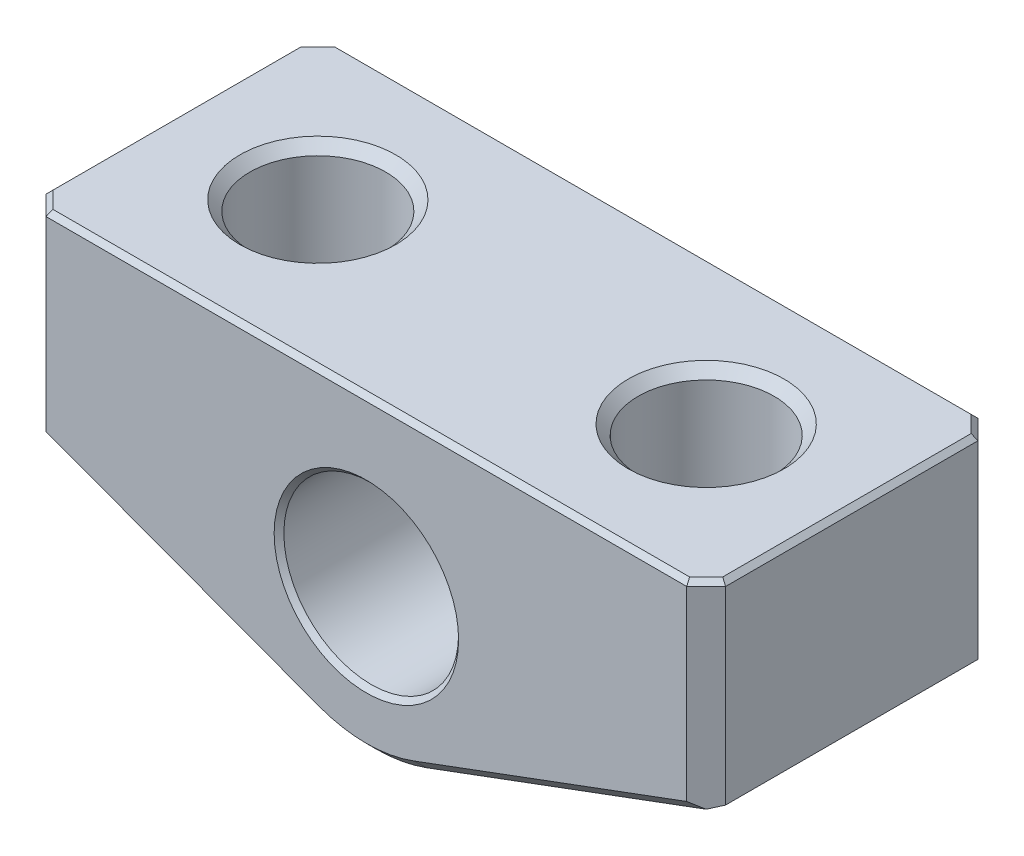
from build123d import *

# Parameters (mm, degrees)
VOLUME_DEPTH                   = 15
VOLUME_DEPTH_BACK              = 15
ESQUISSE1_R                    = 9
TROUS_TARAUD_S_M16_D           = 14
TROUS_TARAUD_S_M16_CSINK_D     = 16.05
TROUS_TARAUD_S_M16_CSINK_ANGLE = 90
CHANFREIN_2MM_SIZE             = 2
CHANFREIN_1MM_SIZE             = 1
CHANFREIN_0_5MM_SIZE           = 0.5


with BuildPart() as part:
    # Esquisse1 → Volume (new, two sides: drawn at the far end of the back side and taken through both)
    with BuildSketch(Plane.XY.offset(-VOLUME_DEPTH_BACK)):
        with BuildLine():
            Line((-35, 17), (35, 17))
            Line((35, 17), (35, -3))
            Line((35, -3), (5.223327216, -14.061182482))
            ThreePointArc((5.223327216, -14.061182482), (0, -15), (-5.223327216, -14.061182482))
            Line((-5.223327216, -14.061182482), (-35, -3))
            Line((-35, -3), (-35, 17))
        make_face()
        Circle(ESQUISSE1_R, mode=Mode.SUBTRACT)
    extrude(amount=VOLUME_DEPTH + VOLUME_DEPTH_BACK)

    # Trous taraud_s M16 (through all)
    with Locations(Plane(origin=(-20, 17, 0), x_dir=(0, 0, 1), z_dir=(0, 1, 0))):
        with Locations((0, 0), (0, 40)):
            CounterSinkHole(TROUS_TARAUD_S_M16_D / 2, TROUS_TARAUD_S_M16_CSINK_D / 2, counter_sink_angle=TROUS_TARAUD_S_M16_CSINK_ANGLE)

    # Chanfrein 2mm
    chanfrein_2mm_edges = [part.edges().sort_by_distance(p)[0] for p in [
        (35, 7, -15),
        (-35, 7, 15),
        (35, 7, 15),
        (-35, 7, -15),
    ]]
    chamfer(chanfrein_2mm_edges, length=CHANFREIN_2MM_SIZE)

    # Chanfrein 1mm
    chanfrein_1mm_edges = [part.edges().sort_by_distance(p)[0] for p in [
        (0, -15, -15),
        (19.111663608, -8.902062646, -15),
        (0, -15, 15),
        (19.111663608, -8.902062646, 15),
        (-19.111663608, -8.902062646, -15),
        (-19.111663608, -8.902062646, 15),
    ]]
    chamfer(chanfrein_1mm_edges, length=CHANFREIN_1MM_SIZE)

    # Chanfrein 0.5mm
    chanfrein_0_5mm_edges = [part.edges().sort_by_distance(p)[0] for p in [
        (-9, 0, -15),
        (-9, 0, 15),
        (35, 17, 0),
        (-35, 17, 0),
        (0, 17, 15),
        (0, 17, -15),
        (-34, 17, -14),
        (-34, 17, 14),
        (34, 17, 14),
        (34, 17, -14),
    ]]
    chamfer(chanfrein_0_5mm_edges, length=CHANFREIN_0_5MM_SIZE)


solid = part.part
